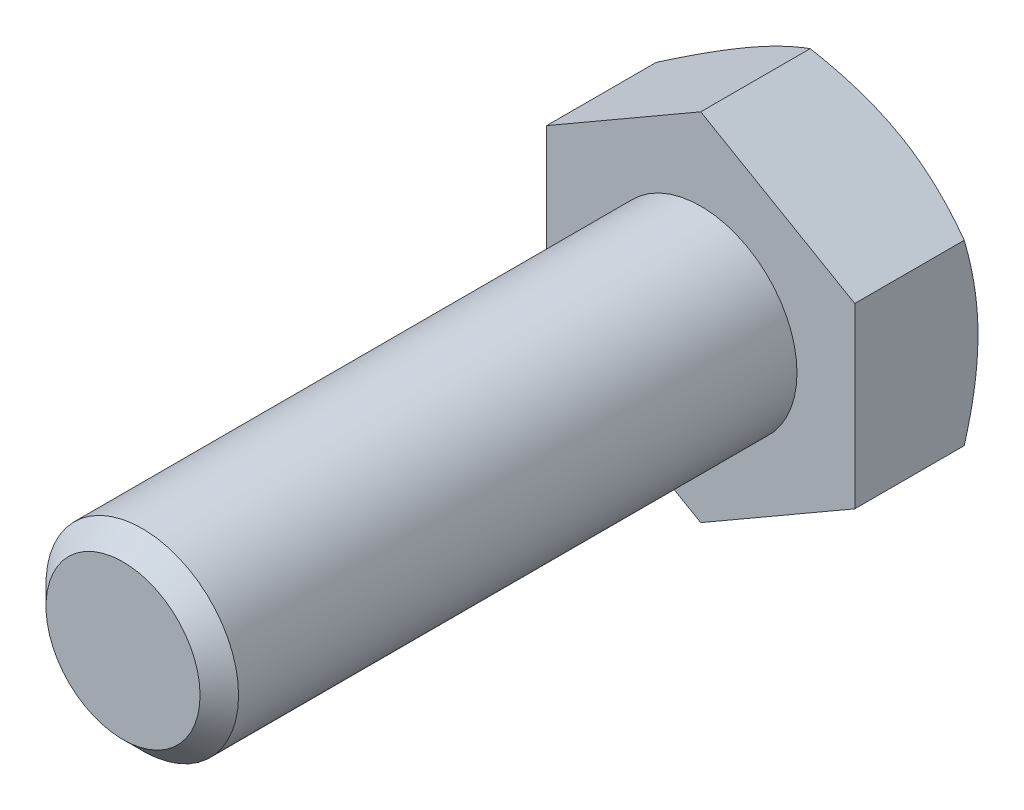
ISO-10303-21;
HEADER;
FILE_DESCRIPTION(('STEP AP214'),'2;1');
FILE_NAME('part.step','',(''),(''),'','','');
FILE_SCHEMA(('AUTOMOTIVE_DESIGN { 1 0 10303 214 1 1 1 1 }'));
ENDSEC;
DATA;
#1=APPLICATION_CONTEXT('core data for automotive mechanical design processes');
#2=APPLICATION_PROTOCOL_DEFINITION('international standard','automotive_design',2000,#1);
#3=PRODUCT_CONTEXT('',#1,'mechanical');
#4=PRODUCT('Part','Part','',(#3));
#5=PRODUCT_RELATED_PRODUCT_CATEGORY('part','',(#4));
#6=PRODUCT_DEFINITION_FORMATION('','',#4);
#7=PRODUCT_DEFINITION_CONTEXT('part definition',#1,'design');
#8=PRODUCT_DEFINITION('design','',#6,#7);
#9=PRODUCT_DEFINITION_SHAPE('','',#8);
#10=(LENGTH_UNIT() NAMED_UNIT(*) SI_UNIT(.MILLI.,.METRE.));
#11=(NAMED_UNIT(*) PLANE_ANGLE_UNIT() SI_UNIT($,.RADIAN.));
#12=(NAMED_UNIT(*) SI_UNIT($,.STERADIAN.) SOLID_ANGLE_UNIT());
#13=UNCERTAINTY_MEASURE_WITH_UNIT(LENGTH_MEASURE(1.E-05),#10,'distance_accuracy_value','');
#14=(GEOMETRIC_REPRESENTATION_CONTEXT(3) GLOBAL_UNCERTAINTY_ASSIGNED_CONTEXT((#13)) GLOBAL_UNIT_ASSIGNED_CONTEXT((#10,
#11,#12)) REPRESENTATION_CONTEXT('',''));
#15=CARTESIAN_POINT('',(0.,0.,0.));
#16=DIRECTION('',(0.,0.,1.));
#17=DIRECTION('',(1.,0.,0.));
#18=AXIS2_PLACEMENT_3D('',#15,#16,#17);
#19=CARTESIAN_POINT('',(0.,0.,30.));
#20=DIRECTION('',(0.,0.,1.));
#21=DIRECTION('',(1.,0.,0.));
#22=AXIS2_PLACEMENT_3D('',#19,#20,#21);
#23=PLANE('',#22);
#24=CARTESIAN_POINT('',(0.,0.,30.));
#25=DIRECTION('',(0.,0.,1.));
#26=DIRECTION('',(1.,0.,0.));
#27=AXIS2_PLACEMENT_3D('',#24,#25,#26);
#28=CIRCLE('',#27,4.);
#29=CARTESIAN_POINT('',(4.,0.,30.));
#30=VERTEX_POINT('',#29);
#31=EDGE_CURVE('E203',#30,#30,#28,.T.);
#32=ORIENTED_EDGE('',*,*,#31,.T.);
#33=EDGE_LOOP('',(#32));
#34=FACE_BOUND('',#33,.T.);
#35=ADVANCED_FACE('F29',(#34),#23,.T.);
#36=CARTESIAN_POINT('',(0.,0.,0.));
#37=DIRECTION('',(0.,0.,1.));
#38=DIRECTION('',(1.,0.,0.));
#39=AXIS2_PLACEMENT_3D('',#36,#37,#38);
#40=CYLINDRICAL_SURFACE('',#39,5.);
#41=CARTESIAN_POINT('',(0.,0.,29.));
#42=DIRECTION('',(0.,0.,1.));
#43=DIRECTION('',(1.,0.,0.));
#44=AXIS2_PLACEMENT_3D('',#41,#42,#43);
#45=CIRCLE('',#44,5.);
#46=CARTESIAN_POINT('',(5.,0.,29.));
#47=VERTEX_POINT('',#46);
#48=EDGE_CURVE('E205',#47,#47,#45,.F.);
#49=ORIENTED_EDGE('',*,*,#48,.T.);
#50=EDGE_LOOP('',(#49));
#51=FACE_BOUND('',#50,.T.);
#52=CARTESIAN_POINT('',(0.,0.,0.));
#53=DIRECTION('',(0.,0.,1.));
#54=DIRECTION('',(1.,0.,0.));
#55=AXIS2_PLACEMENT_3D('',#52,#53,#54);
#56=CIRCLE('',#55,5.);
#57=CARTESIAN_POINT('',(5.,0.,0.));
#58=VERTEX_POINT('',#57);
#59=EDGE_CURVE('E206',#58,#58,#56,.F.);
#60=ORIENTED_EDGE('',*,*,#59,.F.);
#61=EDGE_LOOP('',(#60));
#62=FACE_BOUND('',#61,.T.);
#63=ADVANCED_FACE('F194',(#51,#62),#40,.T.);
#64=CARTESIAN_POINT('',(0.,0.,30.));
#65=DIRECTION('',(0.,0.,-1.));
#66=DIRECTION('',(-1.,0.,0.));
#67=AXIS2_PLACEMENT_3D('',#64,#65,#66);
#68=CONICAL_SURFACE('',#67,4.,0.785398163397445);
#69=ORIENTED_EDGE('',*,*,#48,.F.);
#70=EDGE_LOOP('',(#69));
#71=FACE_BOUND('',#70,.T.);
#72=ORIENTED_EDGE('',*,*,#31,.F.);
#73=EDGE_LOOP('',(#72));
#74=FACE_BOUND('',#73,.T.);
#75=ADVANCED_FACE('F199',(#71,#74),#68,.T.);
#76=CARTESIAN_POINT('',(0.,9.23760430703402,-6.4));
#77=DIRECTION('',(0.499999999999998,0.86602540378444,0.));
#78=DIRECTION('',(-0.86602540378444,0.499999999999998,0.));
#79=AXIS2_PLACEMENT_3D('',#76,#77,#78);
#80=PLANE('',#79);
#81=CARTESIAN_POINT('',(-0.000200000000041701,9.23771977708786,-5.68540215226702));
#82=CARTESIAN_POINT('',(0.175648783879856,9.13619343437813,-5.74400928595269));
#83=CARTESIAN_POINT('',(0.352153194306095,9.03428856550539,-5.7999565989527));
#84=CARTESIAN_POINT('',(0.70659546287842,8.82965122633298,-5.90579899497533));
#85=CARTESIAN_POINT('',(0.884533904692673,8.72691841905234,-5.95569146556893));
#86=CARTESIAN_POINT('',(1.42119823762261,8.41707512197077,-6.09530720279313));
#87=CARTESIAN_POINT('',(1.78204258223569,8.20874154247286,-6.17471882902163));
#88=CARTESIAN_POINT('',(2.32203917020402,7.89697436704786,-6.26783835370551));
#89=CARTESIAN_POINT('',(2.49957818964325,7.79447216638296,-6.29436541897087));
#90=CARTESIAN_POINT('',(2.85545911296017,7.58900421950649,-6.33884682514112));
#91=CARTESIAN_POINT('',(3.03380094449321,7.48603851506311,-6.35680192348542));
#92=CARTESIAN_POINT('',(3.39079168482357,7.27992981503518,-6.38368435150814));
#93=CARTESIAN_POINT('',(3.56944001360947,7.17678715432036,-6.39262192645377));
#94=CARTESIAN_POINT('',(3.92690170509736,6.97040655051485,-6.40127769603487));
#95=CARTESIAN_POINT('',(4.10571506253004,6.86716861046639,-6.40099617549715));
#96=CARTESIAN_POINT('',(4.44001336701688,6.67416139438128,-6.39185497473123));
#97=CARTESIAN_POINT('',(4.59552190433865,6.58437849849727,-6.38411039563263));
#98=CARTESIAN_POINT('',(4.90617476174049,6.4050229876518,-6.36179886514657));
#99=CARTESIAN_POINT('',(5.06131905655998,6.31545038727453,-6.34723145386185));
#100=CARTESIAN_POINT('',(5.5261513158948,6.04707935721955,-6.29363930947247));
#101=CARTESIAN_POINT('',(5.83501648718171,5.86875596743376,-6.24473135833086));
#102=CARTESIAN_POINT('',(6.45602322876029,5.51021755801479,-6.12246059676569));
#103=CARTESIAN_POINT('',(6.76808554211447,5.33004829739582,-6.048579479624));
#104=CARTESIAN_POINT('',(7.38755648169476,4.97239658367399,-5.88089985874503));
#105=CARTESIAN_POINT('',(7.69497304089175,4.79490955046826,-5.78714073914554));
#106=CARTESIAN_POINT('',(8.0002,4.61868668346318,-5.68540215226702));
#107=B_SPLINE_CURVE_WITH_KNOTS('',3,(#81,#82,#83,#84,#85,#86,#87,#88,#89,#90,#91,#92,#93,#94,
#95,#96,#97,#98,#99,#100,#101,#102,#103,#104,#105,#106),.UNSPECIFIED.,.F.,.F.,(4,2,2,2,2,2,2,2,
2,2,2,2,4),(0.,0.633973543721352,1.26821965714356,2.53934712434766,3.1593434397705,
3.77928496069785,4.39852133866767,5.01773858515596,5.5568023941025,6.09590254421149,
7.17487077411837,8.27776850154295,9.37850115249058),.UNSPECIFIED.);
#108=CARTESIAN_POINT('',(0.,9.23760430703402,-5.68546882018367));
#109=VERTEX_POINT('',#108);
#110=CARTESIAN_POINT('',(3.99999999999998,6.92820323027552,-6.4));
#111=VERTEX_POINT('',#110);
#112=EDGE_CURVE('E239',#109,#111,#107,.T.);
#113=ORIENTED_EDGE('',*,*,#112,.F.);
#114=DIRECTION('',(0.,0.,1.));
#115=VECTOR('',#114,1.);
#116=CARTESIAN_POINT('',(0.,9.23760430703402,-6.4));
#117=LINE('',#116,#115);
#118=CARTESIAN_POINT('',(0.,9.23760430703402,0.));
#119=VERTEX_POINT('',#118);
#120=EDGE_CURVE('E213',#109,#119,#117,.T.);
#121=ORIENTED_EDGE('',*,*,#120,.T.);
#122=DIRECTION('',(-0.86602540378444,0.499999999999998,0.));
#123=VECTOR('',#122,1.);
#124=CARTESIAN_POINT('',(0.,9.23760430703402,0.));
#125=LINE('',#124,#123);
#126=CARTESIAN_POINT('',(8.,4.61880215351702,0.));
#127=VERTEX_POINT('',#126);
#128=EDGE_CURVE('E237',#127,#119,#125,.T.);
#129=ORIENTED_EDGE('',*,*,#128,.F.);
#130=DIRECTION('',(0.,0.,1.));
#131=VECTOR('',#130,1.);
#132=CARTESIAN_POINT('',(8.,4.61880215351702,-6.4));
#133=LINE('',#132,#131);
#134=CARTESIAN_POINT('',(8.,4.61880215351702,-5.68546882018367));
#135=VERTEX_POINT('',#134);
#136=EDGE_CURVE('E210',#135,#127,#133,.T.);
#137=ORIENTED_EDGE('',*,*,#136,.F.);
#138=EDGE_CURVE('E169',#111,#135,#107,.T.);
#139=ORIENTED_EDGE('',*,*,#138,.F.);
#140=EDGE_LOOP('',(#113,#121,#129,#137,#139));
#141=FACE_BOUND('',#140,.T.);
#142=ADVANCED_FACE('F179',(#141),#80,.T.);
#143=CARTESIAN_POINT('',(8.,-4.61880215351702,-6.4));
#144=DIRECTION('',(1.,0.,0.));
#145=DIRECTION('',(0.,0.,-1.));
#146=AXIS2_PLACEMENT_3D('',#143,#144,#145);
#147=PLANE('',#146);
#148=CARTESIAN_POINT('',(8.,-12.5978512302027,-2.40281206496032));
#149=CARTESIAN_POINT('',(8.,-12.246746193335,-2.57388946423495));
#150=CARTESIAN_POINT('',(8.,-11.8948553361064,-2.74338074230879));
#151=CARTESIAN_POINT('',(8.,-11.1890846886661,-3.07830251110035));
#152=CARTESIAN_POINT('',(8.,-10.835204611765,-3.24373239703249));
#153=CARTESIAN_POINT('',(8.,-10.1233054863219,-3.57043443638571));
#154=CARTESIAN_POINT('',(8.,-9.76527449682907,-3.73168065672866));
#155=CARTESIAN_POINT('',(8.,-9.04643054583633,-4.04782365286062));
#156=CARTESIAN_POINT('',(8.,-8.68561771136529,-4.20272071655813));
#157=CARTESIAN_POINT('',(8.,-7.94836823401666,-4.50960168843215));
#158=CARTESIAN_POINT('',(8.,-7.57181608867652,-4.66130959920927));
#159=CARTESIAN_POINT('',(8.,-6.81437869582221,-4.95369969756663));
#160=CARTESIAN_POINT('',(8.,-6.43349297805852,-5.09438067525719));
#161=CARTESIAN_POINT('',(8.,-5.66743059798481,-5.36116349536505));
#162=CARTESIAN_POINT('',(8.,-5.28226375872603,-5.48729325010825));
#163=CARTESIAN_POINT('',(8.,-4.50642197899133,-5.72105487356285));
#164=CARTESIAN_POINT('',(8.,-4.11574875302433,-5.82869236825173));
#165=CARTESIAN_POINT('',(8.,-3.33076858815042,-6.01985550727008));
#166=CARTESIAN_POINT('',(8.,-2.9364953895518,-6.10351603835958));
#167=CARTESIAN_POINT('',(8.,-2.34134760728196,-6.20749259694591));
#168=CARTESIAN_POINT('',(8.,-2.1423290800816,-6.23856705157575));
#169=CARTESIAN_POINT('',(8.,-1.7432391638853,-6.29294025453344));
#170=CARTESIAN_POINT('',(8.,-1.54316787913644,-6.31623975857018));
#171=CARTESIAN_POINT('',(8.,-1.14493807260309,-6.35429623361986));
#172=CARTESIAN_POINT('',(8.,-0.94679021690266,-6.36916434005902));
#173=CARTESIAN_POINT('',(8.,-0.550042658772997,-6.39050002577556));
#174=CARTESIAN_POINT('',(8.,-0.351442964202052,-6.39696775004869));
#175=CARTESIAN_POINT('',(8.,0.0458536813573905,-6.40134753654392));
#176=CARTESIAN_POINT('',(8.,0.244550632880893,-6.39925955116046));
#177=CARTESIAN_POINT('',(8.,0.641675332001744,-6.38658102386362));
#178=CARTESIAN_POINT('',(8.,0.840103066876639,-6.37599009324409));
#179=CARTESIAN_POINT('',(8.,1.31123186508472,-6.3409781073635));
#180=CARTESIAN_POINT('',(8.,1.58366327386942,-6.31284309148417));
#181=CARTESIAN_POINT('',(8.,2.12661564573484,-6.24203710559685));
#182=CARTESIAN_POINT('',(8.,2.39713636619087,-6.19936432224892));
#183=CARTESIAN_POINT('',(8.,3.20545284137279,-6.0517930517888));
#184=CARTESIAN_POINT('',(8.,3.73973646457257,-5.9273641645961));
#185=CARTESIAN_POINT('',(8.,4.53906436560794,-5.71012995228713));
#186=CARTESIAN_POINT('',(8.,4.80821183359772,-5.63154182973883));
#187=CARTESIAN_POINT('',(8.,5.34389592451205,-5.46584170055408));
#188=CARTESIAN_POINT('',(8.,5.61043252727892,-5.37872962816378));
#189=CARTESIAN_POINT('',(8.,6.14097486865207,-5.1974091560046));
#190=CARTESIAN_POINT('',(8.,6.40498129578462,-5.10320275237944));
#191=CARTESIAN_POINT('',(8.,6.93077992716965,-4.90883812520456));
#192=CARTESIAN_POINT('',(8.,7.19257218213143,-4.8086800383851));
#193=CARTESIAN_POINT('',(8.,7.89757234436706,-4.53123135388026));
#194=CARTESIAN_POINT('',(8.,8.33892089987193,-4.34922056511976));
#195=CARTESIAN_POINT('',(8.,9.21706508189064,-3.97449001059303));
#196=CARTESIAN_POINT('',(8.,9.6538601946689,-3.78176905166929));
#197=CARTESIAN_POINT('',(8.,10.5239434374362,-3.38815487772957));
#198=CARTESIAN_POINT('',(8.,10.9572301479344,-3.18725853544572));
#199=CARTESIAN_POINT('',(8.,11.8208356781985,-2.77925077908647));
#200=CARTESIAN_POINT('',(8.,12.251154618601,-2.57213961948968));
#201=CARTESIAN_POINT('',(8.,13.1101061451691,-2.15271844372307));
#202=CARTESIAN_POINT('',(8.,13.5387348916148,-1.94040058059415));
#203=CARTESIAN_POINT('',(8.,14.3940561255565,-1.51189757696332));
#204=CARTESIAN_POINT('',(8.,14.8207485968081,-1.29571240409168));
#205=CARTESIAN_POINT('',(8.,15.672448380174,-0.860283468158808));
#206=CARTESIAN_POINT('',(8.,16.0974560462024,-0.641040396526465));
#207=CARTESIAN_POINT('',(8.,16.9461557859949,-0.200021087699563));
#208=CARTESIAN_POINT('',(8.,17.3698478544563,0.0217551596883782));
#209=CARTESIAN_POINT('',(8.,18.5495919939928,0.64296873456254));
#210=CARTESIAN_POINT('',(8.,19.3044430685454,1.04468640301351));
#211=CARTESIAN_POINT('',(8.,20.8116128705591,1.85294502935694));
#212=CARTESIAN_POINT('',(8.,21.5639314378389,2.25948628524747));
#213=CARTESIAN_POINT('',(8.,23.0640825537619,3.074790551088));
#214=CARTESIAN_POINT('',(8.,23.8119216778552,3.48354147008));
#215=CARTESIAN_POINT('',(8.,24.9325210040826,4.09870759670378));
#216=CARTESIAN_POINT('',(8.,25.3058462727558,4.30409483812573));
#217=CARTESIAN_POINT('',(8.,26.0521604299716,4.71547851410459));
#218=CARTESIAN_POINT('',(8.,26.4251493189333,4.92147494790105));
#219=CARTESIAN_POINT('',(8.,26.7979906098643,5.12773824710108));
#220=B_SPLINE_CURVE_WITH_KNOTS('',3,(#148,#149,#150,#151,#152,#153,#154,#155,#156,#157,#158,
#159,#160,#161,#162,#163,#164,#165,#166,#167,#168,#169,#170,#171,#172,#173,#174,#175,#176,#177,
#178,#179,#180,#181,#182,#183,#184,#185,#186,#187,#188,#189,#190,#191,#192,#193,#194,#195,#196,
#197,#198,#199,#200,#201,#202,#203,#204,#205,#206,#207,#208,#209,#210,#211,#212,#213,#214,#215,
#216,#217,#218,#219),.UNSPECIFIED.,.F.,.F.,(4,2,2,2,2,2,2,2,2,2,2,2,2,2,2,2,2,2,2,2,2,2,2,2,2,2,
2,2,2,2,2,2,2,2,2,4),(0.,1.17171303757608,2.34359951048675,3.52154779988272,4.69944261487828,
5.91720060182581,7.13509201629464,8.35060698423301,9.56575149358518,10.7739194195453,
11.3780811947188,11.982184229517,12.5781274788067,13.1740604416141,13.7699967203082,
14.3659602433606,15.1871414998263,16.0084252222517,17.651791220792,18.4928743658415,
19.3339639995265,20.1748178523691,21.0156523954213,22.4476587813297,23.8798250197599,
25.312544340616,26.7452050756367,28.1801767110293,29.6151603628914,31.0498246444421,
32.48449470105,35.0497345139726,37.6151336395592,40.1718943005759,41.4501744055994,
42.7284529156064),.UNSPECIFIED.);
#221=CARTESIAN_POINT('',(8.,0.,-6.4));
#222=VERTEX_POINT('',#221);
#223=EDGE_CURVE('E167',#135,#222,#220,.F.);
#224=ORIENTED_EDGE('',*,*,#223,.F.);
#225=ORIENTED_EDGE('',*,*,#136,.T.);
#226=DIRECTION('',(0.,1.,0.));
#227=VECTOR('',#226,1.);
#228=CARTESIAN_POINT('',(8.,-4.61880215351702,0.));
#229=LINE('',#228,#227);
#230=CARTESIAN_POINT('',(8.,-4.61880215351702,0.));
#231=VERTEX_POINT('',#230);
#232=EDGE_CURVE('E215',#231,#127,#229,.T.);
#233=ORIENTED_EDGE('',*,*,#232,.F.);
#234=DIRECTION('',(0.,0.,1.));
#235=VECTOR('',#234,1.);
#236=CARTESIAN_POINT('',(8.,-4.61880215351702,-6.4));
#237=LINE('',#236,#235);
#238=CARTESIAN_POINT('',(8.,-4.61880215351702,-5.68546882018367));
#239=VERTEX_POINT('',#238);
#240=EDGE_CURVE('E221',#239,#231,#237,.T.);
#241=ORIENTED_EDGE('',*,*,#240,.F.);
#242=EDGE_CURVE('E162',#222,#239,#220,.F.);
#243=ORIENTED_EDGE('',*,*,#242,.F.);
#244=EDGE_LOOP('',(#224,#225,#233,#241,#243));
#245=FACE_BOUND('',#244,.T.);
#246=ADVANCED_FACE('F175',(#245),#147,.T.);
#247=CARTESIAN_POINT('',(0.,-9.23760430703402,-6.4));
#248=DIRECTION('',(0.499999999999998,-0.86602540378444,0.));
#249=DIRECTION('',(0.86602540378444,0.499999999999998,0.));
#250=AXIS2_PLACEMENT_3D('',#247,#248,#249);
#251=PLANE('',#250);
#252=CARTESIAN_POINT('',(8.0002,-4.61868668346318,-5.68540215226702));
#253=CARTESIAN_POINT('',(7.8243512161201,-4.72021302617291,-5.74400928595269));
#254=CARTESIAN_POINT('',(7.64784680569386,-4.82211789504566,-5.7999565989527));
#255=CARTESIAN_POINT('',(7.29340453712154,-5.02675523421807,-5.90579899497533));
#256=CARTESIAN_POINT('',(7.11546609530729,-5.12948804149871,-5.95569146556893));
#257=CARTESIAN_POINT('',(6.57880176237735,-5.43933133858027,-6.09530720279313));
#258=CARTESIAN_POINT('',(6.21795741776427,-5.64766491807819,-6.17471882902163));
#259=CARTESIAN_POINT('',(5.67796082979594,-5.95943209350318,-6.26783835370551));
#260=CARTESIAN_POINT('',(5.50042181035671,-6.06193429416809,-6.29436541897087));
#261=CARTESIAN_POINT('',(5.14454088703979,-6.26740224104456,-6.33884682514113));
#262=CARTESIAN_POINT('',(4.96619905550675,-6.37036794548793,-6.35680192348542));
#263=CARTESIAN_POINT('',(4.60920831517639,-6.57647664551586,-6.38368435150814));
#264=CARTESIAN_POINT('',(4.43055998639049,-6.67961930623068,-6.39262192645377));
#265=CARTESIAN_POINT('',(4.0730982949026,-6.88599991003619,-6.40127769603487));
#266=CARTESIAN_POINT('',(3.89428493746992,-6.98923785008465,-6.40099617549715));
#267=CARTESIAN_POINT('',(3.55998663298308,-7.18224506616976,-6.39185497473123));
#268=CARTESIAN_POINT('',(3.40447809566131,-7.27202796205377,-6.38411039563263));
#269=CARTESIAN_POINT('',(3.09382523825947,-7.45138347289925,-6.36179886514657));
#270=CARTESIAN_POINT('',(2.93868094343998,-7.54095607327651,-6.34723145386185));
#271=CARTESIAN_POINT('',(2.47384868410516,-7.80932710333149,-6.29363930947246));
#272=CARTESIAN_POINT('',(2.16498351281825,-7.98765049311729,-6.24473135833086));
#273=CARTESIAN_POINT('',(1.54397677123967,-8.34618890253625,-6.12246059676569));
#274=CARTESIAN_POINT('',(1.23191445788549,-8.52635816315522,-6.048579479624));
#275=CARTESIAN_POINT('',(0.612443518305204,-8.88400987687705,-5.88089985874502));
#276=CARTESIAN_POINT('',(0.30502695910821,-9.06149691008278,-5.78714073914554));
#277=CARTESIAN_POINT('',(-0.000200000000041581,-9.23771977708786,-5.68540215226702));
#278=B_SPLINE_CURVE_WITH_KNOTS('',3,(#252,#253,#254,#255,#256,#257,#258,#259,#260,#261,#262,
#263,#264,#265,#266,#267,#268,#269,#270,#271,#272,#273,#274,#275,#276,#277),.UNSPECIFIED.,.F.,
.F.,(4,2,2,2,2,2,2,2,2,2,2,2,4),(0.,0.633973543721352,1.26821965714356,2.53934712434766,
3.1593434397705,3.77928496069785,4.39852133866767,5.01773858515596,5.5568023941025,
6.09590254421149,7.17487077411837,8.27776850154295,9.37850115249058),.UNSPECIFIED.);
#279=CARTESIAN_POINT('',(3.99999999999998,-6.92820323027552,-6.4));
#280=VERTEX_POINT('',#279);
#281=EDGE_CURVE('E168',#239,#280,#278,.T.);
#282=ORIENTED_EDGE('',*,*,#281,.F.);
#283=ORIENTED_EDGE('',*,*,#240,.T.);
#284=DIRECTION('',(0.86602540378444,0.499999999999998,0.));
#285=VECTOR('',#284,1.);
#286=CARTESIAN_POINT('',(0.,-9.23760430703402,0.));
#287=LINE('',#286,#285);
#288=CARTESIAN_POINT('',(0.,-9.23760430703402,0.));
#289=VERTEX_POINT('',#288);
#290=EDGE_CURVE('E226',#289,#231,#287,.T.);
#291=ORIENTED_EDGE('',*,*,#290,.F.);
#292=DIRECTION('',(0.,0.,1.));
#293=VECTOR('',#292,1.);
#294=CARTESIAN_POINT('',(0.,-9.23760430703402,-6.4));
#295=LINE('',#294,#293);
#296=CARTESIAN_POINT('',(0.,-9.23760430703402,-5.68546882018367));
#297=VERTEX_POINT('',#296);
#298=EDGE_CURVE('E219',#297,#289,#295,.T.);
#299=ORIENTED_EDGE('',*,*,#298,.F.);
#300=EDGE_CURVE('E156',#280,#297,#278,.T.);
#301=ORIENTED_EDGE('',*,*,#300,.F.);
#302=EDGE_LOOP('',(#282,#283,#291,#299,#301));
#303=FACE_BOUND('',#302,.T.);
#304=ADVANCED_FACE('F178',(#303),#251,.T.);
#305=CARTESIAN_POINT('',(0.,-9.23760430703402,-6.4));
#306=DIRECTION('',(-0.500000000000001,-0.866025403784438,0.));
#307=DIRECTION('',(0.866025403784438,-0.500000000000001,0.));
#308=AXIS2_PLACEMENT_3D('',#305,#306,#307);
#309=PLANE('',#308);
#310=CARTESIAN_POINT('',(0.000199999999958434,-9.23771977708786,-5.68540215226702));
#311=CARTESIAN_POINT('',(-0.175648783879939,-9.13619343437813,-5.74400928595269));
#312=CARTESIAN_POINT('',(-0.352153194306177,-9.03428856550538,-5.7999565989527));
#313=CARTESIAN_POINT('',(-0.706595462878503,-8.82965122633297,-5.90579899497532));
#314=CARTESIAN_POINT('',(-0.884533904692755,-8.72691841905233,-5.95569146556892));
#315=CARTESIAN_POINT('',(-1.42119823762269,-8.41707512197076,-6.09530720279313));
#316=CARTESIAN_POINT('',(-1.78204258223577,-8.20874154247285,-6.17471882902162));
#317=CARTESIAN_POINT('',(-2.3220391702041,-7.89697436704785,-6.2678383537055));
#318=CARTESIAN_POINT('',(-2.49957818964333,-7.79447216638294,-6.29436541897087));
#319=CARTESIAN_POINT('',(-2.85545911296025,-7.58900421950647,-6.33884682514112));
#320=CARTESIAN_POINT('',(-3.03380094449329,-7.4860385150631,-6.35680192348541));
#321=CARTESIAN_POINT('',(-3.39079168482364,-7.27992981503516,-6.38368435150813));
#322=CARTESIAN_POINT('',(-3.56944001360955,-7.17678715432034,-6.39262192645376));
#323=CARTESIAN_POINT('',(-3.92690170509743,-6.97040655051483,-6.40127769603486));
#324=CARTESIAN_POINT('',(-4.10571506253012,-6.86716861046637,-6.40099617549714));
#325=CARTESIAN_POINT('',(-4.44001336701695,-6.67416139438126,-6.39185497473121));
#326=CARTESIAN_POINT('',(-4.59552190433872,-6.58437849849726,-6.38411039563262));
#327=CARTESIAN_POINT('',(-4.90617476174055,-6.40502298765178,-6.36179886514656));
#328=CARTESIAN_POINT('',(-5.06131905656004,-6.31545038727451,-6.34723145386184));
#329=CARTESIAN_POINT('',(-5.52615131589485,-6.04707935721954,-6.29363930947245));
#330=CARTESIAN_POINT('',(-5.83501648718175,-5.86875596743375,-6.24473135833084));
#331=CARTESIAN_POINT('',(-6.45602322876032,-5.51021755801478,-6.12246059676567));
#332=CARTESIAN_POINT('',(-6.7680855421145,-5.33004829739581,-6.04857947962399));
#333=CARTESIAN_POINT('',(-7.38755648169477,-4.97239658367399,-5.88089985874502));
#334=CARTESIAN_POINT('',(-7.69497304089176,-4.79490955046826,-5.78714073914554));
#335=CARTESIAN_POINT('',(-8.0002,-4.61868668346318,-5.68540215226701));
#336=B_SPLINE_CURVE_WITH_KNOTS('',3,(#310,#311,#312,#313,#314,#315,#316,#317,#318,#319,#320,
#321,#322,#323,#324,#325,#326,#327,#328,#329,#330,#331,#332,#333,#334,#335),.UNSPECIFIED.,.F.,
.F.,(4,2,2,2,2,2,2,2,2,2,2,2,4),(0.,0.633973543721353,1.26821965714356,2.53934712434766,
3.1593434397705,3.77928496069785,4.39852133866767,5.01773858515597,5.55680239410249,
6.09590254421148,7.17487077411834,8.2777685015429,9.37850115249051),.UNSPECIFIED.);
#337=CARTESIAN_POINT('',(-4.00000000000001,-6.9282032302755,-6.4));
#338=VERTEX_POINT('',#337);
#339=EDGE_CURVE('E258',#297,#338,#336,.T.);
#340=ORIENTED_EDGE('',*,*,#339,.F.);
#341=ORIENTED_EDGE('',*,*,#298,.T.);
#342=DIRECTION('',(0.866025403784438,-0.500000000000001,0.));
#343=VECTOR('',#342,1.);
#344=CARTESIAN_POINT('',(0.,-9.23760430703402,0.));
#345=LINE('',#344,#343);
#346=CARTESIAN_POINT('',(-8.,-4.61880215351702,0.));
#347=VERTEX_POINT('',#346);
#348=EDGE_CURVE('E229',#347,#289,#345,.T.);
#349=ORIENTED_EDGE('',*,*,#348,.F.);
#350=DIRECTION('',(0.,0.,1.));
#351=VECTOR('',#350,1.);
#352=CARTESIAN_POINT('',(-8.,-4.61880215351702,-6.4));
#353=LINE('',#352,#351);
#354=CARTESIAN_POINT('',(-8.,-4.61880215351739,-5.68546882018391));
#355=VERTEX_POINT('',#354);
#356=EDGE_CURVE('E217',#355,#347,#353,.T.);
#357=ORIENTED_EDGE('',*,*,#356,.F.);
#358=EDGE_CURVE('E105',#338,#355,#336,.T.);
#359=ORIENTED_EDGE('',*,*,#358,.F.);
#360=EDGE_LOOP('',(#340,#341,#349,#357,#359));
#361=FACE_BOUND('',#360,.T.);
#362=ADVANCED_FACE('F183',(#361),#309,.T.);
#363=CARTESIAN_POINT('',(-8.,-4.61880215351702,-6.4));
#364=DIRECTION('',(-1.,0.,0.));
#365=DIRECTION('',(0.,0.,1.));
#366=AXIS2_PLACEMENT_3D('',#363,#364,#365);
#367=PLANE('',#366);
#368=CARTESIAN_POINT('',(-8.,-12.5978512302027,-2.40281206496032));
#369=CARTESIAN_POINT('',(-8.,-12.246746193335,-2.57388946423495));
#370=CARTESIAN_POINT('',(-8.,-11.8948553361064,-2.74338074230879));
#371=CARTESIAN_POINT('',(-8.,-11.1890846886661,-3.07830251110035));
#372=CARTESIAN_POINT('',(-8.,-10.835204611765,-3.24373239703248));
#373=CARTESIAN_POINT('',(-8.,-10.1233054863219,-3.57043443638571));
#374=CARTESIAN_POINT('',(-8.,-9.76527449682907,-3.73168065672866));
#375=CARTESIAN_POINT('',(-8.,-9.04643054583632,-4.04782365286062));
#376=CARTESIAN_POINT('',(-8.,-8.68561771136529,-4.20272071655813));
#377=CARTESIAN_POINT('',(-8.,-7.94836823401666,-4.50960168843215));
#378=CARTESIAN_POINT('',(-8.,-7.57181608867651,-4.66130959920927));
#379=CARTESIAN_POINT('',(-8.,-6.8143786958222,-4.95369969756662));
#380=CARTESIAN_POINT('',(-8.,-6.43349297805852,-5.09438067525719));
#381=CARTESIAN_POINT('',(-8.,-5.66743059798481,-5.36116349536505));
#382=CARTESIAN_POINT('',(-8.,-5.28226375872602,-5.48729325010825));
#383=CARTESIAN_POINT('',(-8.,-4.50642197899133,-5.72105487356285));
#384=CARTESIAN_POINT('',(-8.,-4.11574875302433,-5.82869236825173));
#385=CARTESIAN_POINT('',(-8.,-3.33076858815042,-6.01985550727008));
#386=CARTESIAN_POINT('',(-8.,-2.9364953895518,-6.10351603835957));
#387=CARTESIAN_POINT('',(-8.,-2.34134760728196,-6.20749259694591));
#388=CARTESIAN_POINT('',(-8.,-2.1423290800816,-6.23856705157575));
#389=CARTESIAN_POINT('',(-8.,-1.7432391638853,-6.29294025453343));
#390=CARTESIAN_POINT('',(-8.,-1.54316787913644,-6.31623975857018));
#391=CARTESIAN_POINT('',(-8.,-1.14493807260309,-6.35429623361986));
#392=CARTESIAN_POINT('',(-8.,-0.946790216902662,-6.36916434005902));
#393=CARTESIAN_POINT('',(-8.,-0.550042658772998,-6.39050002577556));
#394=CARTESIAN_POINT('',(-8.,-0.351442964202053,-6.39696775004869));
#395=CARTESIAN_POINT('',(-8.,0.0458536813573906,-6.40134753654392));
#396=CARTESIAN_POINT('',(-8.,0.244550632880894,-6.39925955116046));
#397=CARTESIAN_POINT('',(-8.,0.641675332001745,-6.38658102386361));
#398=CARTESIAN_POINT('',(-8.,0.84010306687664,-6.37599009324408));
#399=CARTESIAN_POINT('',(-8.,1.31123186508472,-6.3409781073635));
#400=CARTESIAN_POINT('',(-8.,1.58366327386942,-6.31284309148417));
#401=CARTESIAN_POINT('',(-8.,2.12661564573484,-6.24203710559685));
#402=CARTESIAN_POINT('',(-8.,2.39713636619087,-6.19936432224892));
#403=CARTESIAN_POINT('',(-8.,3.20545284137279,-6.0517930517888));
#404=CARTESIAN_POINT('',(-8.,3.73973646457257,-5.92736416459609));
#405=CARTESIAN_POINT('',(-8.,4.53906436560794,-5.71012995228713));
#406=CARTESIAN_POINT('',(-8.,4.80821183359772,-5.63154182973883));
#407=CARTESIAN_POINT('',(-8.,5.34389592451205,-5.46584170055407));
#408=CARTESIAN_POINT('',(-8.,5.61043252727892,-5.37872962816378));
#409=CARTESIAN_POINT('',(-8.,6.14097486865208,-5.1974091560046));
#410=CARTESIAN_POINT('',(-8.,6.40498129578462,-5.10320275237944));
#411=CARTESIAN_POINT('',(-8.,6.93077992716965,-4.90883812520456));
#412=CARTESIAN_POINT('',(-8.,7.19257218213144,-4.8086800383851));
#413=CARTESIAN_POINT('',(-8.,7.89757234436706,-4.53123135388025));
#414=CARTESIAN_POINT('',(-8.,8.33892089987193,-4.34922056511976));
#415=CARTESIAN_POINT('',(-8.,9.21706508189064,-3.97449001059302));
#416=CARTESIAN_POINT('',(-8.,9.6538601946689,-3.78176905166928));
#417=CARTESIAN_POINT('',(-8.,10.5239434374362,-3.38815487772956));
#418=CARTESIAN_POINT('',(-8.,10.9572301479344,-3.18725853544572));
#419=CARTESIAN_POINT('',(-8.,11.8208356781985,-2.77925077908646));
#420=CARTESIAN_POINT('',(-8.,12.251154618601,-2.57213961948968));
#421=CARTESIAN_POINT('',(-8.,13.1101061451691,-2.15271844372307));
#422=CARTESIAN_POINT('',(-8.,13.5387348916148,-1.94040058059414));
#423=CARTESIAN_POINT('',(-8.,14.3940561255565,-1.51189757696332));
#424=CARTESIAN_POINT('',(-8.,14.8207485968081,-1.29571240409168));
#425=CARTESIAN_POINT('',(-8.,15.672448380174,-0.860283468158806));
#426=CARTESIAN_POINT('',(-8.,16.0974560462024,-0.641040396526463));
#427=CARTESIAN_POINT('',(-8.,16.9461557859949,-0.200021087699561));
#428=CARTESIAN_POINT('',(-8.,17.3698478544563,0.0217551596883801));
#429=CARTESIAN_POINT('',(-8.,18.5495919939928,0.642968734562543));
#430=CARTESIAN_POINT('',(-8.,19.3044430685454,1.04468640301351));
#431=CARTESIAN_POINT('',(-8.,20.8116128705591,1.85294502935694));
#432=CARTESIAN_POINT('',(-8.,21.5639314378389,2.25948628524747));
#433=CARTESIAN_POINT('',(-8.,23.0640825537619,3.07479055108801));
#434=CARTESIAN_POINT('',(-8.,23.8119216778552,3.48354147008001));
#435=CARTESIAN_POINT('',(-8.,24.9325210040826,4.09870759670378));
#436=CARTESIAN_POINT('',(-8.,25.3058462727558,4.30409483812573));
#437=CARTESIAN_POINT('',(-8.,26.0521604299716,4.71547851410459));
#438=CARTESIAN_POINT('',(-8.,26.4251493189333,4.92147494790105));
#439=CARTESIAN_POINT('',(-8.,26.7979906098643,5.12773824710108));
#440=B_SPLINE_CURVE_WITH_KNOTS('',3,(#368,#369,#370,#371,#372,#373,#374,#375,#376,#377,#378,
#379,#380,#381,#382,#383,#384,#385,#386,#387,#388,#389,#390,#391,#392,#393,#394,#395,#396,#397,
#398,#399,#400,#401,#402,#403,#404,#405,#406,#407,#408,#409,#410,#411,#412,#413,#414,#415,#416,
#417,#418,#419,#420,#421,#422,#423,#424,#425,#426,#427,#428,#429,#430,#431,#432,#433,#434,#435,
#436,#437,#438,#439),.UNSPECIFIED.,.F.,.F.,(4,2,2,2,2,2,2,2,2,2,2,2,2,2,2,2,2,2,2,2,2,2,2,2,2,2,
2,2,2,2,2,2,2,2,2,4),(0.,1.17171303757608,2.34359951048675,3.52154779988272,4.69944261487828,
5.91720060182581,7.13509201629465,8.35060698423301,9.56575149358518,10.7739194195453,
11.3780811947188,11.982184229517,12.5781274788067,13.1740604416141,13.7699967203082,
14.3659602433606,15.1871414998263,16.0084252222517,17.651791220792,18.4928743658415,
19.3339639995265,20.1748178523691,21.0156523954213,22.4476587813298,23.8798250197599,
25.312544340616,26.7452050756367,28.1801767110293,29.6151603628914,31.0498246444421,
32.48449470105,35.0497345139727,37.6151336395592,40.1718943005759,41.4501744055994,
42.7284529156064),.UNSPECIFIED.);
#441=CARTESIAN_POINT('',(-8.,0.,-6.4));
#442=VERTEX_POINT('',#441);
#443=EDGE_CURVE('E100',#355,#442,#440,.T.);
#444=ORIENTED_EDGE('',*,*,#443,.F.);
#445=ORIENTED_EDGE('',*,*,#356,.T.);
#446=DIRECTION('',(0.,-1.,0.));
#447=VECTOR('',#446,1.);
#448=CARTESIAN_POINT('',(-8.,-4.61880215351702,0.));
#449=LINE('',#448,#447);
#450=CARTESIAN_POINT('',(-8.,4.61880215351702,0.));
#451=VERTEX_POINT('',#450);
#452=EDGE_CURVE('E232',#451,#347,#449,.T.);
#453=ORIENTED_EDGE('',*,*,#452,.F.);
#454=DIRECTION('',(0.,0.,1.));
#455=VECTOR('',#454,1.);
#456=CARTESIAN_POINT('',(-8.,4.61880215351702,-6.4));
#457=LINE('',#456,#455);
#458=CARTESIAN_POINT('',(-8.,4.61880215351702,-5.68546882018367));
#459=VERTEX_POINT('',#458);
#460=EDGE_CURVE('E126',#459,#451,#457,.T.);
#461=ORIENTED_EDGE('',*,*,#460,.F.);
#462=EDGE_CURVE('E109',#442,#459,#440,.T.);
#463=ORIENTED_EDGE('',*,*,#462,.F.);
#464=EDGE_LOOP('',(#444,#445,#453,#461,#463));
#465=FACE_BOUND('',#464,.T.);
#466=ADVANCED_FACE('F124',(#465),#367,.T.);
#467=CARTESIAN_POINT('',(-8.,4.61880215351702,-6.4));
#468=DIRECTION('',(-0.500000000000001,0.866025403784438,0.));
#469=DIRECTION('',(-0.866025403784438,-0.500000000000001,0.));
#470=AXIS2_PLACEMENT_3D('',#467,#468,#469);
#471=PLANE('',#470);
#472=CARTESIAN_POINT('',(-8.0002,4.61868668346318,-5.68540215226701));
#473=CARTESIAN_POINT('',(-7.8243512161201,4.72021302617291,-5.74400928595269));
#474=CARTESIAN_POINT('',(-7.64784680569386,4.82211789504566,-5.7999565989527));
#475=CARTESIAN_POINT('',(-7.29340453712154,5.02675523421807,-5.90579899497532));
#476=CARTESIAN_POINT('',(-7.11546609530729,5.12948804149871,-5.95569146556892));
#477=CARTESIAN_POINT('',(-6.57880176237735,5.43933133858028,-6.09530720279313));
#478=CARTESIAN_POINT('',(-6.21795741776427,5.6476649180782,-6.17471882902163));
#479=CARTESIAN_POINT('',(-5.67796082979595,5.95943209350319,-6.2678383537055));
#480=CARTESIAN_POINT('',(-5.50042181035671,6.0619342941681,-6.29436541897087));
#481=CARTESIAN_POINT('',(-5.1445408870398,6.26740224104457,-6.33884682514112));
#482=CARTESIAN_POINT('',(-4.96619905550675,6.37036794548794,-6.35680192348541));
#483=CARTESIAN_POINT('',(-4.6092083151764,6.57647664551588,-6.38368435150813));
#484=CARTESIAN_POINT('',(-4.43055998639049,6.6796193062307,-6.39262192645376));
#485=CARTESIAN_POINT('',(-4.07309829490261,6.88599991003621,-6.40127769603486));
#486=CARTESIAN_POINT('',(-3.89428493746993,6.98923785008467,-6.40099617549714));
#487=CARTESIAN_POINT('',(-3.55998663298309,7.18224506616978,-6.39185497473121));
#488=CARTESIAN_POINT('',(-3.40447809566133,7.27202796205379,-6.38411039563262));
#489=CARTESIAN_POINT('',(-3.09382523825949,7.45138347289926,-6.36179886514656));
#490=CARTESIAN_POINT('',(-2.93868094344,7.54095607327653,-6.34723145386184));
#491=CARTESIAN_POINT('',(-2.47384868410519,7.80932710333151,-6.29363930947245));
#492=CARTESIAN_POINT('',(-2.16498351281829,7.9876504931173,-6.24473135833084));
#493=CARTESIAN_POINT('',(-1.54397677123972,8.34618890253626,-6.12246059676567));
#494=CARTESIAN_POINT('',(-1.23191445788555,8.52635816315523,-6.04857947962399));
#495=CARTESIAN_POINT('',(-0.612443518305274,8.88400987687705,-5.88089985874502));
#496=CARTESIAN_POINT('',(-0.305026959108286,9.06149691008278,-5.78714073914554));
#497=CARTESIAN_POINT('',(0.000199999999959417,9.23771977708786,-5.68540215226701));
#498=B_SPLINE_CURVE_WITH_KNOTS('',3,(#472,#473,#474,#475,#476,#477,#478,#479,#480,#481,#482,
#483,#484,#485,#486,#487,#488,#489,#490,#491,#492,#493,#494,#495,#496,#497),.UNSPECIFIED.,.F.,
.F.,(4,2,2,2,2,2,2,2,2,2,2,2,4),(0.,0.633973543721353,1.26821965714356,2.53934712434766,
3.1593434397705,3.77928496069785,4.39852133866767,5.01773858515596,5.55680239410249,
6.09590254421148,7.17487077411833,8.2777685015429,9.37850115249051),.UNSPECIFIED.);
#499=CARTESIAN_POINT('',(-4.00000000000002,6.92820323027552,-6.4));
#500=VERTEX_POINT('',#499);
#501=EDGE_CURVE('E115',#459,#500,#498,.T.);
#502=ORIENTED_EDGE('',*,*,#501,.F.);
#503=ORIENTED_EDGE('',*,*,#460,.T.);
#504=DIRECTION('',(-0.866025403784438,-0.500000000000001,0.));
#505=VECTOR('',#504,1.);
#506=CARTESIAN_POINT('',(-8.,4.61880215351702,0.));
#507=LINE('',#506,#505);
#508=EDGE_CURVE('E235',#119,#451,#507,.T.);
#509=ORIENTED_EDGE('',*,*,#508,.F.);
#510=ORIENTED_EDGE('',*,*,#120,.F.);
#511=EDGE_CURVE('E117',#500,#109,#498,.T.);
#512=ORIENTED_EDGE('',*,*,#511,.F.);
#513=EDGE_LOOP('',(#502,#503,#509,#510,#512));
#514=FACE_BOUND('',#513,.T.);
#515=ADVANCED_FACE('F191',(#514),#471,.T.);
#516=CARTESIAN_POINT('',(8.,4.61880215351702,0.));
#517=DIRECTION('',(0.,0.,1.));
#518=DIRECTION('',(1.,0.,0.));
#519=AXIS2_PLACEMENT_3D('',#516,#517,#518);
#520=PLANE('',#519);
#521=ORIENTED_EDGE('',*,*,#59,.T.);
#522=EDGE_LOOP('',(#521));
#523=FACE_BOUND('',#522,.T.);
#524=ORIENTED_EDGE('',*,*,#128,.T.);
#525=ORIENTED_EDGE('',*,*,#508,.T.);
#526=ORIENTED_EDGE('',*,*,#452,.T.);
#527=ORIENTED_EDGE('',*,*,#348,.T.);
#528=ORIENTED_EDGE('',*,*,#290,.T.);
#529=ORIENTED_EDGE('',*,*,#232,.T.);
#530=EDGE_LOOP('',(#524,#525,#526,#527,#528,#529));
#531=FACE_BOUND('',#530,.T.);
#532=ADVANCED_FACE('F148',(#523,#531),#520,.T.);
#533=CARTESIAN_POINT('',(0.,0.,0.));
#534=DIRECTION('',(0.,0.,1.));
#535=DIRECTION('',(1.,0.,0.));
#536=AXIS2_PLACEMENT_3D('',#533,#534,#535);
#537=CONICAL_SURFACE('',#536,19.0851251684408,1.0471975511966);
#538=ORIENTED_EDGE('',*,*,#138,.T.);
#539=ORIENTED_EDGE('',*,*,#223,.T.);
#540=CARTESIAN_POINT('',(0.,0.,-6.4));
#541=DIRECTION('',(0.,0.,1.));
#542=DIRECTION('',(1.,0.,0.));
#543=AXIS2_PLACEMENT_3D('',#540,#541,#542);
#544=CIRCLE('',#543,8.);
#545=EDGE_CURVE('E32',#111,#222,#544,.F.);
#546=ORIENTED_EDGE('',*,*,#545,.F.);
#547=EDGE_LOOP('',(#538,#539,#546));
#548=FACE_BOUND('',#547,.T.);
#549=ADVANCED_FACE('F248',(#548),#537,.T.);
#550=ORIENTED_EDGE('',*,*,#112,.T.);
#551=EDGE_CURVE('E122',#500,#111,#544,.F.);
#552=ORIENTED_EDGE('',*,*,#551,.F.);
#553=ORIENTED_EDGE('',*,*,#511,.T.);
#554=EDGE_LOOP('',(#550,#552,#553));
#555=FACE_BOUND('',#554,.T.);
#556=ADVANCED_FACE('F147',(#555),#537,.T.);
#557=ORIENTED_EDGE('',*,*,#462,.T.);
#558=ORIENTED_EDGE('',*,*,#501,.T.);
#559=CARTESIAN_POINT('',(0.,0.,-6.4));
#560=DIRECTION('',(0.,0.,-1.));
#561=DIRECTION('',(-1.,0.,0.));
#562=AXIS2_PLACEMENT_3D('',#559,#560,#561);
#563=CIRCLE('',#562,8.);
#564=EDGE_CURVE('E50',#442,#500,#563,.T.);
#565=ORIENTED_EDGE('',*,*,#564,.F.);
#566=EDGE_LOOP('',(#557,#558,#565));
#567=FACE_BOUND('',#566,.T.);
#568=ADVANCED_FACE('F113',(#567),#537,.T.);
#569=ORIENTED_EDGE('',*,*,#358,.T.);
#570=ORIENTED_EDGE('',*,*,#443,.T.);
#571=EDGE_CURVE('E102',#338,#442,#544,.F.);
#572=ORIENTED_EDGE('',*,*,#571,.F.);
#573=EDGE_LOOP('',(#569,#570,#572));
#574=FACE_BOUND('',#573,.T.);
#575=ADVANCED_FACE('F101',(#574),#537,.T.);
#576=ORIENTED_EDGE('',*,*,#300,.T.);
#577=ORIENTED_EDGE('',*,*,#339,.T.);
#578=EDGE_CURVE('E37',#280,#338,#544,.F.);
#579=ORIENTED_EDGE('',*,*,#578,.F.);
#580=EDGE_LOOP('',(#576,#577,#579));
#581=FACE_BOUND('',#580,.T.);
#582=ADVANCED_FACE('F260',(#581),#537,.T.);
#583=ORIENTED_EDGE('',*,*,#242,.T.);
#584=ORIENTED_EDGE('',*,*,#281,.T.);
#585=EDGE_CURVE('E11',#222,#280,#544,.F.);
#586=ORIENTED_EDGE('',*,*,#585,.F.);
#587=EDGE_LOOP('',(#583,#584,#586));
#588=FACE_BOUND('',#587,.T.);
#589=ADVANCED_FACE('F255',(#588),#537,.T.);
#590=CARTESIAN_POINT('',(8.,4.61880215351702,-6.4));
#591=DIRECTION('',(0.,0.,1.));
#592=DIRECTION('',(1.,0.,0.));
#593=AXIS2_PLACEMENT_3D('',#590,#591,#592);
#594=PLANE('',#593);
#595=ORIENTED_EDGE('',*,*,#545,.T.);
#596=ORIENTED_EDGE('',*,*,#585,.T.);
#597=ORIENTED_EDGE('',*,*,#578,.T.);
#598=ORIENTED_EDGE('',*,*,#571,.T.);
#599=ORIENTED_EDGE('',*,*,#564,.T.);
#600=ORIENTED_EDGE('',*,*,#551,.T.);
#601=EDGE_LOOP('',(#595,#596,#597,#598,#599,#600));
#602=FACE_BOUND('',#601,.T.);
#603=ADVANCED_FACE('F120',(#602),#594,.F.);
#604=CLOSED_SHELL('',(#35,#63,#75,#142,#246,#304,#362,#466,#515,#532,#549,#556,#568,#575,#582,
#589,#603));
#605=MANIFOLD_SOLID_BREP('B2',#604);
#606=ADVANCED_BREP_SHAPE_REPRESENTATION('',(#18,#605),#14);
#607=SHAPE_DEFINITION_REPRESENTATION(#9,#606);
ENDSEC;
END-ISO-10303-21;
